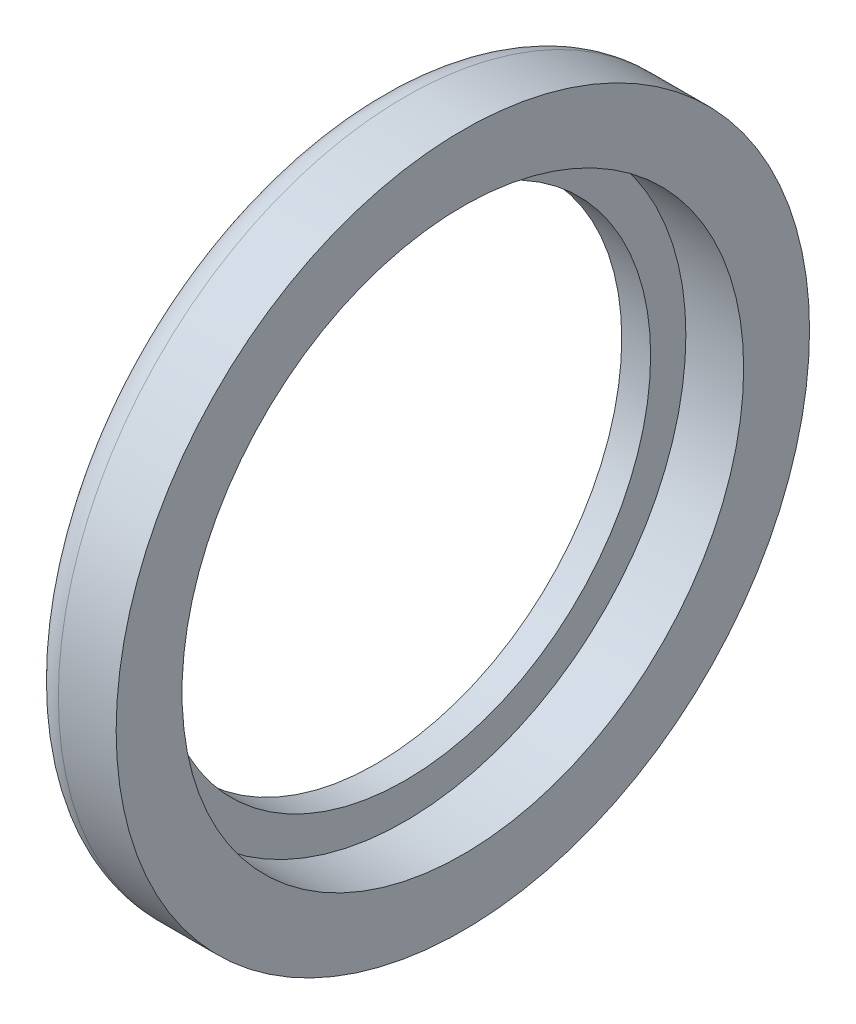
from build123d import *

# Parameters (mm, degrees)
FILLET1_R = 3.175


with BuildPart() as part:
    # Sketch1 → Revolve1 (revolve)
    with BuildSketch(Plane.XY, mode=Mode.PRIVATE) as revolve1_sk:
        Polygon((0, 38.1), (-9.525, 38.1), (-9.525, 26.9875), (-6.35, 26.9875), (-6.35, 30.861), (0, 30.861), align=None)
    revolve(revolve1_sk.sketch.rotate(Axis((0, 0, 0), (-1, 0, 0)), 90), axis=Axis((0, 0, 0), (-1, 0, 0)))

    # Fillet1
    fillet1_edges = [part.edges().sort_by_distance(p)[0] for p in [
        (-9.525, 0, 38.1),
    ]]
    fillet(fillet1_edges, radius=FILLET1_R)


solid = part.part
